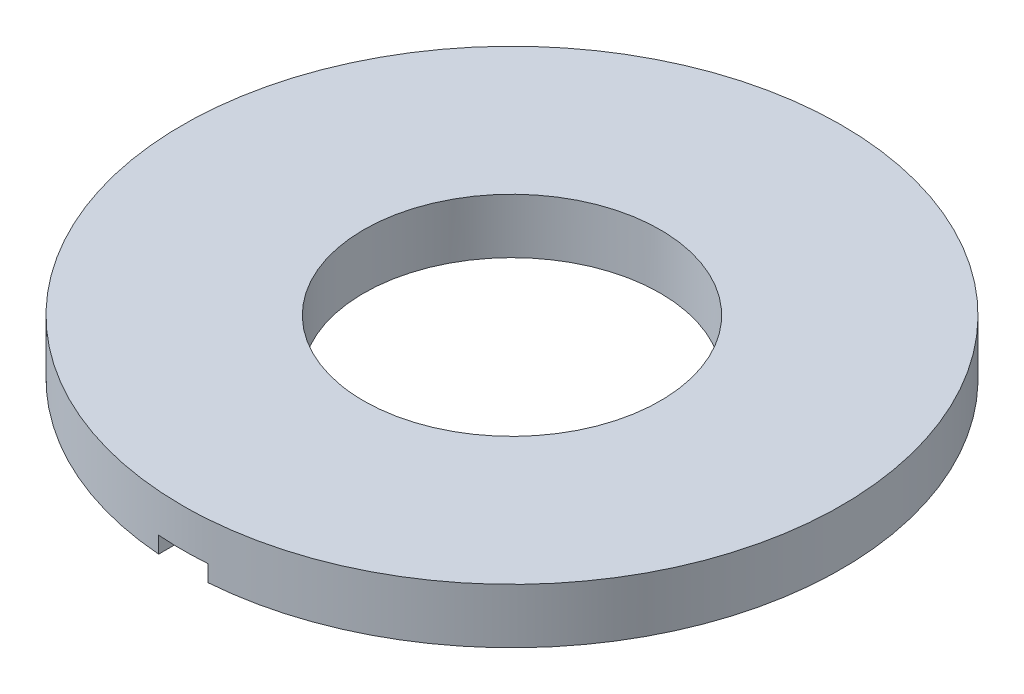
ISO-10303-21;
HEADER;
FILE_DESCRIPTION(('STEP AP214'),'2;1');
FILE_NAME('part.step','',(''),(''),'','','');
FILE_SCHEMA(('AUTOMOTIVE_DESIGN { 1 0 10303 214 1 1 1 1 }'));
ENDSEC;
DATA;
#1=APPLICATION_CONTEXT('core data for automotive mechanical design processes');
#2=APPLICATION_PROTOCOL_DEFINITION('international standard','automotive_design',2000,#1);
#3=PRODUCT_CONTEXT('',#1,'mechanical');
#4=PRODUCT('Part','Part','',(#3));
#5=PRODUCT_RELATED_PRODUCT_CATEGORY('part','',(#4));
#6=PRODUCT_DEFINITION_FORMATION('','',#4);
#7=PRODUCT_DEFINITION_CONTEXT('part definition',#1,'design');
#8=PRODUCT_DEFINITION('design','',#6,#7);
#9=PRODUCT_DEFINITION_SHAPE('','',#8);
#10=(LENGTH_UNIT() NAMED_UNIT(*) SI_UNIT(.MILLI.,.METRE.));
#11=(NAMED_UNIT(*) PLANE_ANGLE_UNIT() SI_UNIT($,.RADIAN.));
#12=(NAMED_UNIT(*) SI_UNIT($,.STERADIAN.) SOLID_ANGLE_UNIT());
#13=UNCERTAINTY_MEASURE_WITH_UNIT(LENGTH_MEASURE(1.E-05),#10,'distance_accuracy_value','');
#14=(GEOMETRIC_REPRESENTATION_CONTEXT(3) GLOBAL_UNCERTAINTY_ASSIGNED_CONTEXT((#13)) GLOBAL_UNIT_ASSIGNED_CONTEXT((#10,
#11,#12)) REPRESENTATION_CONTEXT('',''));
#15=CARTESIAN_POINT('',(0.,0.,0.));
#16=DIRECTION('',(0.,0.,1.));
#17=DIRECTION('',(1.,0.,0.));
#18=AXIS2_PLACEMENT_3D('',#15,#16,#17);
#19=CARTESIAN_POINT('',(0.,0.5,0.));
#20=DIRECTION('',(0.,1.,0.));
#21=DIRECTION('',(0.,0.,1.));
#22=AXIS2_PLACEMENT_3D('',#19,#20,#21);
#23=PLANE('',#22);
#24=CARTESIAN_POINT('',(0.,0.5,0.));
#25=DIRECTION('',(0.,1.,0.));
#26=DIRECTION('',(0.,0.,1.));
#27=AXIS2_PLACEMENT_3D('',#24,#25,#26);
#28=CIRCLE('',#27,3.);
#29=CARTESIAN_POINT('',(0.,0.5,3.));
#30=VERTEX_POINT('',#29);
#31=EDGE_CURVE('E113',#30,#30,#28,.T.);
#32=ORIENTED_EDGE('',*,*,#31,.T.);
#33=EDGE_LOOP('',(#32));
#34=FACE_BOUND('',#33,.T.);
#35=CARTESIAN_POINT('',(0.,0.5,0.));
#36=DIRECTION('',(0.,1.,0.));
#37=DIRECTION('',(0.,0.,1.));
#38=AXIS2_PLACEMENT_3D('',#35,#36,#37);
#39=CIRCLE('',#38,1.35);
#40=CARTESIAN_POINT('',(0.,0.5,1.35));
#41=VERTEX_POINT('',#40);
#42=EDGE_CURVE('E102',#41,#41,#39,.T.);
#43=ORIENTED_EDGE('',*,*,#42,.F.);
#44=EDGE_LOOP('',(#43));
#45=FACE_BOUND('',#44,.T.);
#46=ADVANCED_FACE('F39',(#34,#45),#23,.T.);
#47=CARTESIAN_POINT('',(0.,0.,0.));
#48=DIRECTION('',(0.,1.,0.));
#49=DIRECTION('',(0.,0.,1.));
#50=AXIS2_PLACEMENT_3D('',#47,#48,#49);
#51=PLANE('',#50);
#52=CARTESIAN_POINT('',(0.,0.,0.));
#53=DIRECTION('',(0.,1.,0.));
#54=DIRECTION('',(0.,0.,1.));
#55=AXIS2_PLACEMENT_3D('',#52,#53,#54);
#56=CIRCLE('',#55,3.);
#57=CARTESIAN_POINT('',(0.225,0.,2.99155060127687));
#58=VERTEX_POINT('',#57);
#59=CARTESIAN_POINT('',(-0.225,0.,2.99155060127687));
#60=VERTEX_POINT('',#59);
#61=EDGE_CURVE('E94',#58,#60,#56,.T.);
#62=ORIENTED_EDGE('',*,*,#61,.F.);
#63=DIRECTION('',(0.,0.,1.));
#64=VECTOR('',#63,1.);
#65=CARTESIAN_POINT('',(0.225,0.,-0.3));
#66=LINE('',#65,#64);
#67=CARTESIAN_POINT('',(0.225,0.,1.33111795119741));
#68=VERTEX_POINT('',#67);
#69=EDGE_CURVE('E81',#68,#58,#66,.T.);
#70=ORIENTED_EDGE('',*,*,#69,.F.);
#71=CARTESIAN_POINT('',(0.,0.,0.));
#72=DIRECTION('',(0.,1.,0.));
#73=DIRECTION('',(0.,0.,1.));
#74=AXIS2_PLACEMENT_3D('',#71,#72,#73);
#75=CIRCLE('',#74,1.35);
#76=CARTESIAN_POINT('',(-0.225,0.,1.33111795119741));
#77=VERTEX_POINT('',#76);
#78=EDGE_CURVE('E92',#68,#77,#75,.T.);
#79=ORIENTED_EDGE('',*,*,#78,.T.);
#80=DIRECTION('',(0.,0.,-1.));
#81=VECTOR('',#80,1.);
#82=CARTESIAN_POINT('',(-0.225,0.,-0.3));
#83=LINE('',#82,#81);
#84=EDGE_CURVE('E96',#60,#77,#83,.T.);
#85=ORIENTED_EDGE('',*,*,#84,.F.);
#86=EDGE_LOOP('',(#62,#70,#79,#85));
#87=FACE_BOUND('',#86,.T.);
#88=ADVANCED_FACE('F90',(#87),#51,.F.);
#89=CARTESIAN_POINT('',(0.,0.5,0.));
#90=DIRECTION('',(0.,-1.,0.));
#91=DIRECTION('',(0.,0.,-1.));
#92=AXIS2_PLACEMENT_3D('',#89,#90,#91);
#93=CYLINDRICAL_SURFACE('',#92,3.);
#94=ORIENTED_EDGE('',*,*,#31,.F.);
#95=EDGE_LOOP('',(#94));
#96=FACE_BOUND('',#95,.T.);
#97=CARTESIAN_POINT('',(0.,0.15,0.));
#98=DIRECTION('',(0.,1.,0.));
#99=DIRECTION('',(0.,0.,1.));
#100=AXIS2_PLACEMENT_3D('',#97,#98,#99);
#101=CIRCLE('',#100,3.);
#102=CARTESIAN_POINT('',(-0.225,0.15,2.99155060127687));
#103=VERTEX_POINT('',#102);
#104=CARTESIAN_POINT('',(0.225,0.15,2.99155060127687));
#105=VERTEX_POINT('',#104);
#106=EDGE_CURVE('E60',#103,#105,#101,.T.);
#107=ORIENTED_EDGE('',*,*,#106,.T.);
#108=DIRECTION('',(0.,-1.,0.));
#109=VECTOR('',#108,1.);
#110=CARTESIAN_POINT('',(0.225,0.5,2.99155060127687));
#111=LINE('',#110,#109);
#112=EDGE_CURVE('E103',#105,#58,#111,.T.);
#113=ORIENTED_EDGE('',*,*,#112,.T.);
#114=ORIENTED_EDGE('',*,*,#61,.T.);
#115=DIRECTION('',(0.,-1.,0.));
#116=VECTOR('',#115,1.);
#117=CARTESIAN_POINT('',(-0.225,0.5,2.99155060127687));
#118=LINE('',#117,#116);
#119=EDGE_CURVE('E110',#60,#103,#118,.F.);
#120=ORIENTED_EDGE('',*,*,#119,.T.);
#121=EDGE_LOOP('',(#107,#113,#114,#120));
#122=FACE_BOUND('',#121,.T.);
#123=ADVANCED_FACE('F41',(#96,#122),#93,.T.);
#124=CARTESIAN_POINT('',(0.,0.5,0.));
#125=DIRECTION('',(0.,-1.,0.));
#126=DIRECTION('',(0.,0.,-1.));
#127=AXIS2_PLACEMENT_3D('',#124,#125,#126);
#128=CYLINDRICAL_SURFACE('',#127,1.35);
#129=DIRECTION('',(0.,-1.,0.));
#130=VECTOR('',#129,1.);
#131=CARTESIAN_POINT('',(0.225,0.5,1.33111795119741));
#132=LINE('',#131,#130);
#133=CARTESIAN_POINT('',(0.225,0.15,1.33111795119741));
#134=VERTEX_POINT('',#133);
#135=EDGE_CURVE('E11',#134,#68,#132,.T.);
#136=ORIENTED_EDGE('',*,*,#135,.F.);
#137=CARTESIAN_POINT('',(0.,0.15,0.));
#138=DIRECTION('',(0.,1.,0.));
#139=DIRECTION('',(0.,0.,1.));
#140=AXIS2_PLACEMENT_3D('',#137,#138,#139);
#141=CIRCLE('',#140,1.35);
#142=CARTESIAN_POINT('',(-0.225,0.15,1.33111795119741));
#143=VERTEX_POINT('',#142);
#144=EDGE_CURVE('E116',#143,#134,#141,.T.);
#145=ORIENTED_EDGE('',*,*,#144,.F.);
#146=DIRECTION('',(0.,-1.,0.));
#147=VECTOR('',#146,1.);
#148=CARTESIAN_POINT('',(-0.225,0.5,1.33111795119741));
#149=LINE('',#148,#147);
#150=EDGE_CURVE('E48',#77,#143,#149,.F.);
#151=ORIENTED_EDGE('',*,*,#150,.F.);
#152=ORIENTED_EDGE('',*,*,#78,.F.);
#153=EDGE_LOOP('',(#136,#145,#151,#152));
#154=FACE_BOUND('',#153,.T.);
#155=ORIENTED_EDGE('',*,*,#42,.T.);
#156=EDGE_LOOP('',(#155));
#157=FACE_BOUND('',#156,.T.);
#158=ADVANCED_FACE('F99',(#154,#157),#128,.F.);
#159=CARTESIAN_POINT('',(0.225,0.15,-0.3));
#160=DIRECTION('',(1.,0.,0.));
#161=DIRECTION('',(0.,0.,-1.));
#162=AXIS2_PLACEMENT_3D('',#159,#160,#161);
#163=PLANE('',#162);
#164=DIRECTION('',(0.,0.,1.));
#165=VECTOR('',#164,1.);
#166=CARTESIAN_POINT('',(0.225,0.15,-0.3));
#167=LINE('',#166,#165);
#168=EDGE_CURVE('E83',#134,#105,#167,.T.);
#169=ORIENTED_EDGE('',*,*,#168,.F.);
#170=ORIENTED_EDGE('',*,*,#135,.T.);
#171=ORIENTED_EDGE('',*,*,#69,.T.);
#172=ORIENTED_EDGE('',*,*,#112,.F.);
#173=EDGE_LOOP('',(#169,#170,#171,#172));
#174=FACE_BOUND('',#173,.T.);
#175=ADVANCED_FACE('F79',(#174),#163,.F.);
#176=CARTESIAN_POINT('',(-0.225,0.15,-0.3));
#177=DIRECTION('',(-1.,0.,0.));
#178=DIRECTION('',(0.,0.,1.));
#179=AXIS2_PLACEMENT_3D('',#176,#177,#178);
#180=PLANE('',#179);
#181=ORIENTED_EDGE('',*,*,#84,.T.);
#182=ORIENTED_EDGE('',*,*,#150,.T.);
#183=DIRECTION('',(0.,0.,-1.));
#184=VECTOR('',#183,1.);
#185=CARTESIAN_POINT('',(-0.225,0.15,-0.3));
#186=LINE('',#185,#184);
#187=EDGE_CURVE('E55',#103,#143,#186,.T.);
#188=ORIENTED_EDGE('',*,*,#187,.F.);
#189=ORIENTED_EDGE('',*,*,#119,.F.);
#190=EDGE_LOOP('',(#181,#182,#188,#189));
#191=FACE_BOUND('',#190,.T.);
#192=ADVANCED_FACE('F122',(#191),#180,.F.);
#193=CARTESIAN_POINT('',(0.,0.15,0.));
#194=DIRECTION('',(0.,1.,0.));
#195=DIRECTION('',(0.,0.,1.));
#196=AXIS2_PLACEMENT_3D('',#193,#194,#195);
#197=PLANE('',#196);
#198=ORIENTED_EDGE('',*,*,#106,.F.);
#199=ORIENTED_EDGE('',*,*,#187,.T.);
#200=ORIENTED_EDGE('',*,*,#144,.T.);
#201=ORIENTED_EDGE('',*,*,#168,.T.);
#202=EDGE_LOOP('',(#198,#199,#200,#201));
#203=FACE_BOUND('',#202,.T.);
#204=ADVANCED_FACE('F124',(#203),#197,.F.);
#205=CLOSED_SHELL('',(#46,#88,#123,#158,#175,#192,#204));
#206=MANIFOLD_SOLID_BREP('B2',#205);
#207=ADVANCED_BREP_SHAPE_REPRESENTATION('',(#18,#206),#14);
#208=SHAPE_DEFINITION_REPRESENTATION(#9,#207);
ENDSEC;
END-ISO-10303-21;
